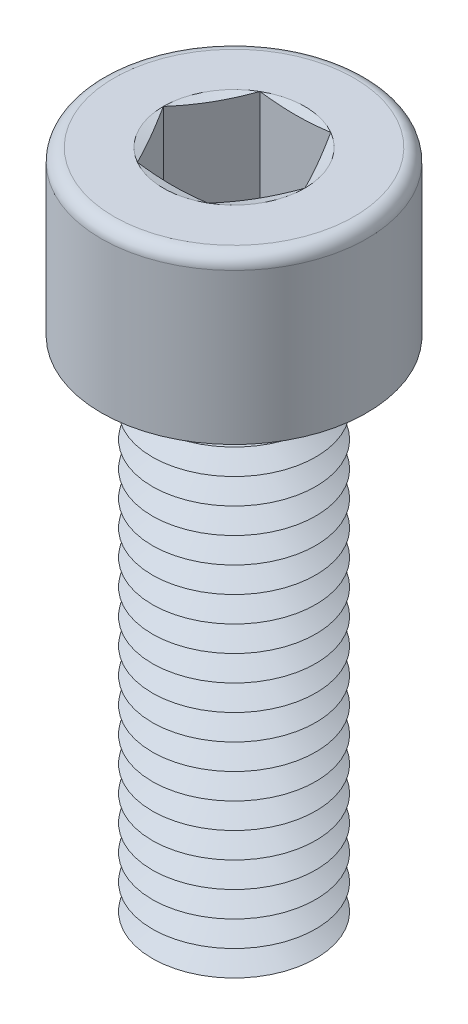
ISO-10303-21;
HEADER;
FILE_DESCRIPTION(('STEP AP214'),'2;1');
FILE_NAME('part.step','',(''),(''),'','','');
FILE_SCHEMA(('AUTOMOTIVE_DESIGN { 1 0 10303 214 1 1 1 1 }'));
ENDSEC;
DATA;
#1=APPLICATION_CONTEXT('core data for automotive mechanical design processes');
#2=APPLICATION_PROTOCOL_DEFINITION('international standard','automotive_design',2000,#1);
#3=PRODUCT_CONTEXT('',#1,'mechanical');
#4=PRODUCT('Part','Part','',(#3));
#5=PRODUCT_RELATED_PRODUCT_CATEGORY('part','',(#4));
#6=PRODUCT_DEFINITION_FORMATION('','',#4);
#7=PRODUCT_DEFINITION_CONTEXT('part definition',#1,'design');
#8=PRODUCT_DEFINITION('design','',#6,#7);
#9=PRODUCT_DEFINITION_SHAPE('','',#8);
#10=(LENGTH_UNIT() NAMED_UNIT(*) SI_UNIT(.MILLI.,.METRE.));
#11=(NAMED_UNIT(*) PLANE_ANGLE_UNIT() SI_UNIT($,.RADIAN.));
#12=(NAMED_UNIT(*) SI_UNIT($,.STERADIAN.) SOLID_ANGLE_UNIT());
#13=UNCERTAINTY_MEASURE_WITH_UNIT(LENGTH_MEASURE(1.E-05),#10,'distance_accuracy_value','');
#14=(GEOMETRIC_REPRESENTATION_CONTEXT(3) GLOBAL_UNCERTAINTY_ASSIGNED_CONTEXT((#13)) GLOBAL_UNIT_ASSIGNED_CONTEXT((#10,
#11,#12)) REPRESENTATION_CONTEXT('',''));
#15=CARTESIAN_POINT('',(0.,0.,0.));
#16=DIRECTION('',(0.,0.,1.));
#17=DIRECTION('',(1.,0.,0.));
#18=AXIS2_PLACEMENT_3D('',#15,#16,#17);
#19=CARTESIAN_POINT('',(0.,5.,0.));
#20=DIRECTION('',(0.,1.,0.));
#21=DIRECTION('',(0.,0.,1.));
#22=AXIS2_PLACEMENT_3D('',#19,#20,#21);
#23=CONICAL_SURFACE('',#22,2.91746824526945,1.0471975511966);
#24=CARTESIAN_POINT('',(0.,5.625,0.));
#25=DIRECTION('',(0.,1.,0.));
#26=DIRECTION('',(0.,0.,1.));
#27=AXIS2_PLACEMENT_3D('',#24,#25,#26);
#28=CIRCLE('',#27,4.);
#29=CARTESIAN_POINT('',(0.,5.625,4.));
#30=VERTEX_POINT('',#29);
#31=EDGE_CURVE('E471',#30,#30,#28,.T.);
#32=ORIENTED_EDGE('',*,*,#31,.F.);
#33=EDGE_LOOP('',(#32));
#34=FACE_BOUND('',#33,.T.);
#35=CARTESIAN_POINT('',(0.,5.,0.));
#36=DIRECTION('',(0.,1.,0.));
#37=DIRECTION('',(0.,0.,1.));
#38=AXIS2_PLACEMENT_3D('',#35,#36,#37);
#39=CIRCLE('',#38,2.91746824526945);
#40=CARTESIAN_POINT('',(0.,5.,2.91746824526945));
#41=VERTEX_POINT('',#40);
#42=EDGE_CURVE('E475',#41,#41,#39,.T.);
#43=ORIENTED_EDGE('',*,*,#42,.T.);
#44=EDGE_LOOP('',(#43));
#45=FACE_BOUND('',#44,.T.);
#46=ADVANCED_FACE('F41',(#34,#45),#23,.T.);
#47=CARTESIAN_POINT('',(0.,4.375,0.));
#48=DIRECTION('',(0.,-1.,0.));
#49=DIRECTION('',(0.,0.,-1.));
#50=AXIS2_PLACEMENT_3D('',#47,#48,#49);
#51=CONICAL_SURFACE('',#50,4.,1.0471975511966);
#52=ORIENTED_EDGE('',*,*,#42,.F.);
#53=EDGE_LOOP('',(#52));
#54=FACE_BOUND('',#53,.T.);
#55=CARTESIAN_POINT('',(0.,4.375,0.));
#56=DIRECTION('',(0.,1.,0.));
#57=DIRECTION('',(0.,0.,1.));
#58=AXIS2_PLACEMENT_3D('',#55,#56,#57);
#59=CIRCLE('',#58,4.);
#60=CARTESIAN_POINT('',(0.,4.375,4.));
#61=VERTEX_POINT('',#60);
#62=EDGE_CURVE('E479',#61,#61,#59,.T.);
#63=ORIENTED_EDGE('',*,*,#62,.T.);
#64=EDGE_LOOP('',(#63));
#65=FACE_BOUND('',#64,.T.);
#66=ADVANCED_FACE('F251',(#54,#65),#51,.T.);
#67=CARTESIAN_POINT('',(0.,0.,0.));
#68=DIRECTION('',(0.,1.,0.));
#69=DIRECTION('',(0.,0.,1.));
#70=AXIS2_PLACEMENT_3D('',#67,#68,#69);
#71=PLANE('',#70);
#72=CARTESIAN_POINT('',(0.,0.,0.));
#73=DIRECTION('',(0.,1.,0.));
#74=DIRECTION('',(0.,0.,1.));
#75=AXIS2_PLACEMENT_3D('',#72,#73,#74);
#76=CIRCLE('',#75,2.91746824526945);
#77=CARTESIAN_POINT('',(0.,0.,2.91746824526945));
#78=VERTEX_POINT('',#77);
#79=EDGE_CURVE('E507',#78,#78,#76,.T.);
#80=ORIENTED_EDGE('',*,*,#79,.F.);
#81=EDGE_LOOP('',(#80));
#82=FACE_BOUND('',#81,.T.);
#83=ADVANCED_FACE('F248',(#82),#71,.F.);
#84=CARTESIAN_POINT('',(0.,0.,0.));
#85=DIRECTION('',(0.,1.,0.));
#86=DIRECTION('',(0.,0.,1.));
#87=AXIS2_PLACEMENT_3D('',#84,#85,#86);
#88=CONICAL_SURFACE('',#87,2.91746824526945,1.0471975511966);
#89=CARTESIAN_POINT('',(0.,0.624999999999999,0.));
#90=DIRECTION('',(0.,1.,0.));
#91=DIRECTION('',(0.,0.,1.));
#92=AXIS2_PLACEMENT_3D('',#89,#90,#91);
#93=CIRCLE('',#92,4.);
#94=CARTESIAN_POINT('',(0.,0.624999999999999,4.));
#95=VERTEX_POINT('',#94);
#96=EDGE_CURVE('E503',#95,#95,#93,.T.);
#97=ORIENTED_EDGE('',*,*,#96,.F.);
#98=EDGE_LOOP('',(#97));
#99=FACE_BOUND('',#98,.T.);
#100=ORIENTED_EDGE('',*,*,#79,.T.);
#101=EDGE_LOOP('',(#100));
#102=FACE_BOUND('',#101,.T.);
#103=ADVANCED_FACE('F250',(#99,#102),#88,.T.);
#104=CARTESIAN_POINT('',(0.,0.624999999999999,0.));
#105=DIRECTION('',(0.,-1.,0.));
#106=DIRECTION('',(0.,0.,-1.));
#107=AXIS2_PLACEMENT_3D('',#104,#105,#106);
#108=CONICAL_SURFACE('',#107,4.,1.0471975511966);
#109=CARTESIAN_POINT('',(0.,1.25,0.));
#110=DIRECTION('',(0.,1.,0.));
#111=DIRECTION('',(0.,0.,1.));
#112=AXIS2_PLACEMENT_3D('',#109,#110,#111);
#113=CIRCLE('',#112,2.91746824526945);
#114=CARTESIAN_POINT('',(0.,1.25,2.91746824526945));
#115=VERTEX_POINT('',#114);
#116=EDGE_CURVE('E499',#115,#115,#113,.T.);
#117=ORIENTED_EDGE('',*,*,#116,.F.);
#118=EDGE_LOOP('',(#117));
#119=FACE_BOUND('',#118,.T.);
#120=ORIENTED_EDGE('',*,*,#96,.T.);
#121=EDGE_LOOP('',(#120));
#122=FACE_BOUND('',#121,.T.);
#123=ADVANCED_FACE('F291',(#119,#122),#108,.T.);
#124=CARTESIAN_POINT('',(0.,1.25,0.));
#125=DIRECTION('',(0.,1.,0.));
#126=DIRECTION('',(0.,0.,1.));
#127=AXIS2_PLACEMENT_3D('',#124,#125,#126);
#128=CONICAL_SURFACE('',#127,2.91746824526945,1.0471975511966);
#129=CARTESIAN_POINT('',(0.,1.875,0.));
#130=DIRECTION('',(0.,1.,0.));
#131=DIRECTION('',(0.,0.,1.));
#132=AXIS2_PLACEMENT_3D('',#129,#130,#131);
#133=CIRCLE('',#132,4.);
#134=CARTESIAN_POINT('',(0.,1.875,4.));
#135=VERTEX_POINT('',#134);
#136=EDGE_CURVE('E495',#135,#135,#133,.T.);
#137=ORIENTED_EDGE('',*,*,#136,.F.);
#138=EDGE_LOOP('',(#137));
#139=FACE_BOUND('',#138,.T.);
#140=ORIENTED_EDGE('',*,*,#116,.T.);
#141=EDGE_LOOP('',(#140));
#142=FACE_BOUND('',#141,.T.);
#143=ADVANCED_FACE('F286',(#139,#142),#128,.T.);
#144=CARTESIAN_POINT('',(0.,1.875,0.));
#145=DIRECTION('',(0.,-1.,0.));
#146=DIRECTION('',(0.,0.,-1.));
#147=AXIS2_PLACEMENT_3D('',#144,#145,#146);
#148=CONICAL_SURFACE('',#147,4.,1.0471975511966);
#149=CARTESIAN_POINT('',(0.,2.5,0.));
#150=DIRECTION('',(0.,1.,0.));
#151=DIRECTION('',(0.,0.,1.));
#152=AXIS2_PLACEMENT_3D('',#149,#150,#151);
#153=CIRCLE('',#152,2.91746824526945);
#154=CARTESIAN_POINT('',(0.,2.5,2.91746824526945));
#155=VERTEX_POINT('',#154);
#156=EDGE_CURVE('E491',#155,#155,#153,.T.);
#157=ORIENTED_EDGE('',*,*,#156,.F.);
#158=EDGE_LOOP('',(#157));
#159=FACE_BOUND('',#158,.T.);
#160=ORIENTED_EDGE('',*,*,#136,.T.);
#161=EDGE_LOOP('',(#160));
#162=FACE_BOUND('',#161,.T.);
#163=ADVANCED_FACE('F283',(#159,#162),#148,.T.);
#164=CARTESIAN_POINT('',(0.,2.5,0.));
#165=DIRECTION('',(0.,1.,0.));
#166=DIRECTION('',(0.,0.,1.));
#167=AXIS2_PLACEMENT_3D('',#164,#165,#166);
#168=CONICAL_SURFACE('',#167,2.91746824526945,1.0471975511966);
#169=CARTESIAN_POINT('',(0.,3.125,0.));
#170=DIRECTION('',(0.,1.,0.));
#171=DIRECTION('',(0.,0.,1.));
#172=AXIS2_PLACEMENT_3D('',#169,#170,#171);
#173=CIRCLE('',#172,4.);
#174=CARTESIAN_POINT('',(0.,3.125,4.));
#175=VERTEX_POINT('',#174);
#176=EDGE_CURVE('E487',#175,#175,#173,.T.);
#177=ORIENTED_EDGE('',*,*,#176,.F.);
#178=EDGE_LOOP('',(#177));
#179=FACE_BOUND('',#178,.T.);
#180=ORIENTED_EDGE('',*,*,#156,.T.);
#181=EDGE_LOOP('',(#180));
#182=FACE_BOUND('',#181,.T.);
#183=ADVANCED_FACE('F277',(#179,#182),#168,.T.);
#184=CARTESIAN_POINT('',(0.,3.125,0.));
#185=DIRECTION('',(0.,-1.,0.));
#186=DIRECTION('',(0.,0.,-1.));
#187=AXIS2_PLACEMENT_3D('',#184,#185,#186);
#188=CONICAL_SURFACE('',#187,4.,1.0471975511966);
#189=CARTESIAN_POINT('',(0.,3.75,0.));
#190=DIRECTION('',(0.,1.,0.));
#191=DIRECTION('',(0.,0.,1.));
#192=AXIS2_PLACEMENT_3D('',#189,#190,#191);
#193=CIRCLE('',#192,2.91746824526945);
#194=CARTESIAN_POINT('',(0.,3.75,2.91746824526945));
#195=VERTEX_POINT('',#194);
#196=EDGE_CURVE('E483',#195,#195,#193,.T.);
#197=ORIENTED_EDGE('',*,*,#196,.F.);
#198=EDGE_LOOP('',(#197));
#199=FACE_BOUND('',#198,.T.);
#200=ORIENTED_EDGE('',*,*,#176,.T.);
#201=EDGE_LOOP('',(#200));
#202=FACE_BOUND('',#201,.T.);
#203=ADVANCED_FACE('F273',(#199,#202),#188,.T.);
#204=CARTESIAN_POINT('',(0.,3.75,0.));
#205=DIRECTION('',(0.,1.,0.));
#206=DIRECTION('',(0.,0.,1.));
#207=AXIS2_PLACEMENT_3D('',#204,#205,#206);
#208=CONICAL_SURFACE('',#207,2.91746824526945,1.0471975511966);
#209=ORIENTED_EDGE('',*,*,#62,.F.);
#210=EDGE_LOOP('',(#209));
#211=FACE_BOUND('',#210,.T.);
#212=ORIENTED_EDGE('',*,*,#196,.T.);
#213=EDGE_LOOP('',(#212));
#214=FACE_BOUND('',#213,.T.);
#215=ADVANCED_FACE('F276',(#211,#214),#208,.T.);
#216=CARTESIAN_POINT('',(0.,6.25,0.));
#217=DIRECTION('',(0.,1.,0.));
#218=DIRECTION('',(0.,0.,1.));
#219=AXIS2_PLACEMENT_3D('',#216,#217,#218);
#220=CONICAL_SURFACE('',#219,2.91746824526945,1.0471975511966);
#221=CARTESIAN_POINT('',(0.,6.875,0.));
#222=DIRECTION('',(0.,1.,0.));
#223=DIRECTION('',(0.,0.,1.));
#224=AXIS2_PLACEMENT_3D('',#221,#222,#223);
#225=CIRCLE('',#224,4.);
#226=CARTESIAN_POINT('',(0.,6.875,4.));
#227=VERTEX_POINT('',#226);
#228=EDGE_CURVE('E463',#227,#227,#225,.T.);
#229=ORIENTED_EDGE('',*,*,#228,.F.);
#230=EDGE_LOOP('',(#229));
#231=FACE_BOUND('',#230,.T.);
#232=CARTESIAN_POINT('',(0.,6.25,0.));
#233=DIRECTION('',(0.,1.,0.));
#234=DIRECTION('',(0.,0.,1.));
#235=AXIS2_PLACEMENT_3D('',#232,#233,#234);
#236=CIRCLE('',#235,2.91746824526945);
#237=CARTESIAN_POINT('',(0.,6.25,2.91746824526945));
#238=VERTEX_POINT('',#237);
#239=EDGE_CURVE('E467',#238,#238,#236,.T.);
#240=ORIENTED_EDGE('',*,*,#239,.T.);
#241=EDGE_LOOP('',(#240));
#242=FACE_BOUND('',#241,.T.);
#243=ADVANCED_FACE('F281',(#231,#242),#220,.T.);
#244=CARTESIAN_POINT('',(0.,5.625,0.));
#245=DIRECTION('',(0.,-1.,0.));
#246=DIRECTION('',(0.,0.,-1.));
#247=AXIS2_PLACEMENT_3D('',#244,#245,#246);
#248=CONICAL_SURFACE('',#247,4.,1.0471975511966);
#249=ORIENTED_EDGE('',*,*,#239,.F.);
#250=EDGE_LOOP('',(#249));
#251=FACE_BOUND('',#250,.T.);
#252=ORIENTED_EDGE('',*,*,#31,.T.);
#253=EDGE_LOOP('',(#252));
#254=FACE_BOUND('',#253,.T.);
#255=ADVANCED_FACE('F744',(#251,#254),#248,.T.);
#256=CARTESIAN_POINT('',(0.,7.5,0.));
#257=DIRECTION('',(0.,1.,0.));
#258=DIRECTION('',(0.,0.,1.));
#259=AXIS2_PLACEMENT_3D('',#256,#257,#258);
#260=CONICAL_SURFACE('',#259,2.91746824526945,1.0471975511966);
#261=CARTESIAN_POINT('',(0.,8.125,0.));
#262=DIRECTION('',(0.,1.,0.));
#263=DIRECTION('',(0.,0.,1.));
#264=AXIS2_PLACEMENT_3D('',#261,#262,#263);
#265=CIRCLE('',#264,4.);
#266=CARTESIAN_POINT('',(0.,8.125,4.));
#267=VERTEX_POINT('',#266);
#268=EDGE_CURVE('E455',#267,#267,#265,.T.);
#269=ORIENTED_EDGE('',*,*,#268,.F.);
#270=EDGE_LOOP('',(#269));
#271=FACE_BOUND('',#270,.T.);
#272=CARTESIAN_POINT('',(0.,7.5,0.));
#273=DIRECTION('',(0.,1.,0.));
#274=DIRECTION('',(0.,0.,1.));
#275=AXIS2_PLACEMENT_3D('',#272,#273,#274);
#276=CIRCLE('',#275,2.91746824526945);
#277=CARTESIAN_POINT('',(0.,7.5,2.91746824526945));
#278=VERTEX_POINT('',#277);
#279=EDGE_CURVE('E459',#278,#278,#276,.T.);
#280=ORIENTED_EDGE('',*,*,#279,.T.);
#281=EDGE_LOOP('',(#280));
#282=FACE_BOUND('',#281,.T.);
#283=ADVANCED_FACE('F753',(#271,#282),#260,.T.);
#284=CARTESIAN_POINT('',(0.,6.875,0.));
#285=DIRECTION('',(0.,-1.,0.));
#286=DIRECTION('',(0.,0.,-1.));
#287=AXIS2_PLACEMENT_3D('',#284,#285,#286);
#288=CONICAL_SURFACE('',#287,4.,1.0471975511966);
#289=ORIENTED_EDGE('',*,*,#279,.F.);
#290=EDGE_LOOP('',(#289));
#291=FACE_BOUND('',#290,.T.);
#292=ORIENTED_EDGE('',*,*,#228,.T.);
#293=EDGE_LOOP('',(#292));
#294=FACE_BOUND('',#293,.T.);
#295=ADVANCED_FACE('F763',(#291,#294),#288,.T.);
#296=CARTESIAN_POINT('',(0.,8.75,0.));
#297=DIRECTION('',(0.,1.,0.));
#298=DIRECTION('',(0.,0.,1.));
#299=AXIS2_PLACEMENT_3D('',#296,#297,#298);
#300=CONICAL_SURFACE('',#299,2.91746824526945,1.0471975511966);
#301=CARTESIAN_POINT('',(0.,9.375,0.));
#302=DIRECTION('',(0.,1.,0.));
#303=DIRECTION('',(0.,0.,1.));
#304=AXIS2_PLACEMENT_3D('',#301,#302,#303);
#305=CIRCLE('',#304,4.);
#306=CARTESIAN_POINT('',(0.,9.375,4.));
#307=VERTEX_POINT('',#306);
#308=EDGE_CURVE('E447',#307,#307,#305,.T.);
#309=ORIENTED_EDGE('',*,*,#308,.F.);
#310=EDGE_LOOP('',(#309));
#311=FACE_BOUND('',#310,.T.);
#312=CARTESIAN_POINT('',(0.,8.75,0.));
#313=DIRECTION('',(0.,1.,0.));
#314=DIRECTION('',(0.,0.,1.));
#315=AXIS2_PLACEMENT_3D('',#312,#313,#314);
#316=CIRCLE('',#315,2.91746824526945);
#317=CARTESIAN_POINT('',(0.,8.75,2.91746824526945));
#318=VERTEX_POINT('',#317);
#319=EDGE_CURVE('E451',#318,#318,#316,.T.);
#320=ORIENTED_EDGE('',*,*,#319,.T.);
#321=EDGE_LOOP('',(#320));
#322=FACE_BOUND('',#321,.T.);
#323=ADVANCED_FACE('F773',(#311,#322),#300,.T.);
#324=CARTESIAN_POINT('',(0.,8.125,0.));
#325=DIRECTION('',(0.,-1.,0.));
#326=DIRECTION('',(0.,0.,-1.));
#327=AXIS2_PLACEMENT_3D('',#324,#325,#326);
#328=CONICAL_SURFACE('',#327,4.,1.0471975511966);
#329=ORIENTED_EDGE('',*,*,#319,.F.);
#330=EDGE_LOOP('',(#329));
#331=FACE_BOUND('',#330,.T.);
#332=ORIENTED_EDGE('',*,*,#268,.T.);
#333=EDGE_LOOP('',(#332));
#334=FACE_BOUND('',#333,.T.);
#335=ADVANCED_FACE('F783',(#331,#334),#328,.T.);
#336=CARTESIAN_POINT('',(0.,10.,0.));
#337=DIRECTION('',(0.,1.,0.));
#338=DIRECTION('',(0.,0.,1.));
#339=AXIS2_PLACEMENT_3D('',#336,#337,#338);
#340=CONICAL_SURFACE('',#339,2.91746824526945,1.0471975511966);
#341=CARTESIAN_POINT('',(0.,10.625,0.));
#342=DIRECTION('',(0.,1.,0.));
#343=DIRECTION('',(0.,0.,1.));
#344=AXIS2_PLACEMENT_3D('',#341,#342,#343);
#345=CIRCLE('',#344,4.);
#346=CARTESIAN_POINT('',(0.,10.625,4.));
#347=VERTEX_POINT('',#346);
#348=EDGE_CURVE('E440',#347,#347,#345,.T.);
#349=ORIENTED_EDGE('',*,*,#348,.F.);
#350=EDGE_LOOP('',(#349));
#351=FACE_BOUND('',#350,.T.);
#352=CARTESIAN_POINT('',(0.,10.,0.));
#353=DIRECTION('',(0.,1.,0.));
#354=DIRECTION('',(0.,0.,1.));
#355=AXIS2_PLACEMENT_3D('',#352,#353,#354);
#356=CIRCLE('',#355,2.91746824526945);
#357=CARTESIAN_POINT('',(0.,10.,2.91746824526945));
#358=VERTEX_POINT('',#357);
#359=EDGE_CURVE('E444',#358,#358,#356,.T.);
#360=ORIENTED_EDGE('',*,*,#359,.T.);
#361=EDGE_LOOP('',(#360));
#362=FACE_BOUND('',#361,.T.);
#363=ADVANCED_FACE('F793',(#351,#362),#340,.T.);
#364=CARTESIAN_POINT('',(0.,9.375,0.));
#365=DIRECTION('',(0.,-1.,0.));
#366=DIRECTION('',(0.,0.,-1.));
#367=AXIS2_PLACEMENT_3D('',#364,#365,#366);
#368=CONICAL_SURFACE('',#367,4.,1.0471975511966);
#369=ORIENTED_EDGE('',*,*,#359,.F.);
#370=EDGE_LOOP('',(#369));
#371=FACE_BOUND('',#370,.T.);
#372=ORIENTED_EDGE('',*,*,#308,.T.);
#373=EDGE_LOOP('',(#372));
#374=FACE_BOUND('',#373,.T.);
#375=ADVANCED_FACE('F803',(#371,#374),#368,.T.);
#376=CARTESIAN_POINT('',(0.,11.25,0.));
#377=DIRECTION('',(0.,1.,0.));
#378=DIRECTION('',(0.,0.,1.));
#379=AXIS2_PLACEMENT_3D('',#376,#377,#378);
#380=CONICAL_SURFACE('',#379,2.91746824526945,1.0471975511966);
#381=CARTESIAN_POINT('',(0.,11.875,0.));
#382=DIRECTION('',(0.,1.,0.));
#383=DIRECTION('',(0.,0.,1.));
#384=AXIS2_PLACEMENT_3D('',#381,#382,#383);
#385=CIRCLE('',#384,4.);
#386=CARTESIAN_POINT('',(0.,11.875,4.));
#387=VERTEX_POINT('',#386);
#388=EDGE_CURVE('E432',#387,#387,#385,.T.);
#389=ORIENTED_EDGE('',*,*,#388,.F.);
#390=EDGE_LOOP('',(#389));
#391=FACE_BOUND('',#390,.T.);
#392=CARTESIAN_POINT('',(0.,11.25,0.));
#393=DIRECTION('',(0.,1.,0.));
#394=DIRECTION('',(0.,0.,1.));
#395=AXIS2_PLACEMENT_3D('',#392,#393,#394);
#396=CIRCLE('',#395,2.91746824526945);
#397=CARTESIAN_POINT('',(0.,11.25,2.91746824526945));
#398=VERTEX_POINT('',#397);
#399=EDGE_CURVE('E436',#398,#398,#396,.T.);
#400=ORIENTED_EDGE('',*,*,#399,.T.);
#401=EDGE_LOOP('',(#400));
#402=FACE_BOUND('',#401,.T.);
#403=ADVANCED_FACE('F813',(#391,#402),#380,.T.);
#404=CARTESIAN_POINT('',(0.,10.625,0.));
#405=DIRECTION('',(0.,-1.,0.));
#406=DIRECTION('',(0.,0.,-1.));
#407=AXIS2_PLACEMENT_3D('',#404,#405,#406);
#408=CONICAL_SURFACE('',#407,4.,1.0471975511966);
#409=ORIENTED_EDGE('',*,*,#399,.F.);
#410=EDGE_LOOP('',(#409));
#411=FACE_BOUND('',#410,.T.);
#412=ORIENTED_EDGE('',*,*,#348,.T.);
#413=EDGE_LOOP('',(#412));
#414=FACE_BOUND('',#413,.T.);
#415=ADVANCED_FACE('F823',(#411,#414),#408,.T.);
#416=CARTESIAN_POINT('',(0.,12.5,0.));
#417=DIRECTION('',(0.,1.,0.));
#418=DIRECTION('',(0.,0.,1.));
#419=AXIS2_PLACEMENT_3D('',#416,#417,#418);
#420=CONICAL_SURFACE('',#419,2.91746824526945,1.0471975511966);
#421=CARTESIAN_POINT('',(0.,13.125,0.));
#422=DIRECTION('',(0.,1.,0.));
#423=DIRECTION('',(0.,0.,1.));
#424=AXIS2_PLACEMENT_3D('',#421,#422,#423);
#425=CIRCLE('',#424,4.);
#426=CARTESIAN_POINT('',(0.,13.125,4.));
#427=VERTEX_POINT('',#426);
#428=EDGE_CURVE('E424',#427,#427,#425,.T.);
#429=ORIENTED_EDGE('',*,*,#428,.F.);
#430=EDGE_LOOP('',(#429));
#431=FACE_BOUND('',#430,.T.);
#432=CARTESIAN_POINT('',(0.,12.5,0.));
#433=DIRECTION('',(0.,1.,0.));
#434=DIRECTION('',(0.,0.,1.));
#435=AXIS2_PLACEMENT_3D('',#432,#433,#434);
#436=CIRCLE('',#435,2.91746824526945);
#437=CARTESIAN_POINT('',(0.,12.5,2.91746824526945));
#438=VERTEX_POINT('',#437);
#439=EDGE_CURVE('E428',#438,#438,#436,.T.);
#440=ORIENTED_EDGE('',*,*,#439,.T.);
#441=EDGE_LOOP('',(#440));
#442=FACE_BOUND('',#441,.T.);
#443=ADVANCED_FACE('F833',(#431,#442),#420,.T.);
#444=CARTESIAN_POINT('',(0.,11.875,0.));
#445=DIRECTION('',(0.,-1.,0.));
#446=DIRECTION('',(0.,0.,-1.));
#447=AXIS2_PLACEMENT_3D('',#444,#445,#446);
#448=CONICAL_SURFACE('',#447,4.,1.0471975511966);
#449=ORIENTED_EDGE('',*,*,#439,.F.);
#450=EDGE_LOOP('',(#449));
#451=FACE_BOUND('',#450,.T.);
#452=ORIENTED_EDGE('',*,*,#388,.T.);
#453=EDGE_LOOP('',(#452));
#454=FACE_BOUND('',#453,.T.);
#455=ADVANCED_FACE('F843',(#451,#454),#448,.T.);
#456=CARTESIAN_POINT('',(0.,13.75,0.));
#457=DIRECTION('',(0.,1.,0.));
#458=DIRECTION('',(0.,0.,1.));
#459=AXIS2_PLACEMENT_3D('',#456,#457,#458);
#460=CONICAL_SURFACE('',#459,2.91746824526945,1.0471975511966);
#461=CARTESIAN_POINT('',(0.,14.375,0.));
#462=DIRECTION('',(0.,1.,0.));
#463=DIRECTION('',(0.,0.,1.));
#464=AXIS2_PLACEMENT_3D('',#461,#462,#463);
#465=CIRCLE('',#464,4.);
#466=CARTESIAN_POINT('',(0.,14.375,4.));
#467=VERTEX_POINT('',#466);
#468=EDGE_CURVE('E416',#467,#467,#465,.T.);
#469=ORIENTED_EDGE('',*,*,#468,.F.);
#470=EDGE_LOOP('',(#469));
#471=FACE_BOUND('',#470,.T.);
#472=CARTESIAN_POINT('',(0.,13.75,0.));
#473=DIRECTION('',(0.,1.,0.));
#474=DIRECTION('',(0.,0.,1.));
#475=AXIS2_PLACEMENT_3D('',#472,#473,#474);
#476=CIRCLE('',#475,2.91746824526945);
#477=CARTESIAN_POINT('',(0.,13.75,2.91746824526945));
#478=VERTEX_POINT('',#477);
#479=EDGE_CURVE('E420',#478,#478,#476,.T.);
#480=ORIENTED_EDGE('',*,*,#479,.T.);
#481=EDGE_LOOP('',(#480));
#482=FACE_BOUND('',#481,.T.);
#483=ADVANCED_FACE('F853',(#471,#482),#460,.T.);
#484=CARTESIAN_POINT('',(0.,13.125,0.));
#485=DIRECTION('',(0.,-1.,0.));
#486=DIRECTION('',(0.,0.,-1.));
#487=AXIS2_PLACEMENT_3D('',#484,#485,#486);
#488=CONICAL_SURFACE('',#487,4.,1.0471975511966);
#489=ORIENTED_EDGE('',*,*,#479,.F.);
#490=EDGE_LOOP('',(#489));
#491=FACE_BOUND('',#490,.T.);
#492=ORIENTED_EDGE('',*,*,#428,.T.);
#493=EDGE_LOOP('',(#492));
#494=FACE_BOUND('',#493,.T.);
#495=ADVANCED_FACE('F863',(#491,#494),#488,.T.);
#496=CARTESIAN_POINT('',(0.,15.,0.));
#497=DIRECTION('',(0.,1.,0.));
#498=DIRECTION('',(0.,0.,1.));
#499=AXIS2_PLACEMENT_3D('',#496,#497,#498);
#500=CONICAL_SURFACE('',#499,2.91746824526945,1.0471975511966);
#501=CARTESIAN_POINT('',(0.,15.625,0.));
#502=DIRECTION('',(0.,1.,0.));
#503=DIRECTION('',(0.,0.,1.));
#504=AXIS2_PLACEMENT_3D('',#501,#502,#503);
#505=CIRCLE('',#504,4.);
#506=CARTESIAN_POINT('',(0.,15.625,4.));
#507=VERTEX_POINT('',#506);
#508=EDGE_CURVE('E408',#507,#507,#505,.T.);
#509=ORIENTED_EDGE('',*,*,#508,.F.);
#510=EDGE_LOOP('',(#509));
#511=FACE_BOUND('',#510,.T.);
#512=CARTESIAN_POINT('',(0.,15.,0.));
#513=DIRECTION('',(0.,1.,0.));
#514=DIRECTION('',(0.,0.,1.));
#515=AXIS2_PLACEMENT_3D('',#512,#513,#514);
#516=CIRCLE('',#515,2.91746824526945);
#517=CARTESIAN_POINT('',(0.,15.,2.91746824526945));
#518=VERTEX_POINT('',#517);
#519=EDGE_CURVE('E412',#518,#518,#516,.T.);
#520=ORIENTED_EDGE('',*,*,#519,.T.);
#521=EDGE_LOOP('',(#520));
#522=FACE_BOUND('',#521,.T.);
#523=ADVANCED_FACE('F873',(#511,#522),#500,.T.);
#524=CARTESIAN_POINT('',(0.,14.375,0.));
#525=DIRECTION('',(0.,-1.,0.));
#526=DIRECTION('',(0.,0.,-1.));
#527=AXIS2_PLACEMENT_3D('',#524,#525,#526);
#528=CONICAL_SURFACE('',#527,4.,1.0471975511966);
#529=ORIENTED_EDGE('',*,*,#519,.F.);
#530=EDGE_LOOP('',(#529));
#531=FACE_BOUND('',#530,.T.);
#532=ORIENTED_EDGE('',*,*,#468,.T.);
#533=EDGE_LOOP('',(#532));
#534=FACE_BOUND('',#533,.T.);
#535=ADVANCED_FACE('F883',(#531,#534),#528,.T.);
#536=CARTESIAN_POINT('',(0.,16.25,0.));
#537=DIRECTION('',(0.,1.,0.));
#538=DIRECTION('',(0.,0.,1.));
#539=AXIS2_PLACEMENT_3D('',#536,#537,#538);
#540=CONICAL_SURFACE('',#539,2.91746824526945,1.0471975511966);
#541=CARTESIAN_POINT('',(0.,16.875,0.));
#542=DIRECTION('',(0.,1.,0.));
#543=DIRECTION('',(0.,0.,1.));
#544=AXIS2_PLACEMENT_3D('',#541,#542,#543);
#545=CIRCLE('',#544,4.);
#546=CARTESIAN_POINT('',(0.,16.875,4.));
#547=VERTEX_POINT('',#546);
#548=EDGE_CURVE('E400',#547,#547,#545,.T.);
#549=ORIENTED_EDGE('',*,*,#548,.F.);
#550=EDGE_LOOP('',(#549));
#551=FACE_BOUND('',#550,.T.);
#552=CARTESIAN_POINT('',(0.,16.25,0.));
#553=DIRECTION('',(0.,1.,0.));
#554=DIRECTION('',(0.,0.,1.));
#555=AXIS2_PLACEMENT_3D('',#552,#553,#554);
#556=CIRCLE('',#555,2.91746824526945);
#557=CARTESIAN_POINT('',(0.,16.25,2.91746824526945));
#558=VERTEX_POINT('',#557);
#559=EDGE_CURVE('E404',#558,#558,#556,.T.);
#560=ORIENTED_EDGE('',*,*,#559,.T.);
#561=EDGE_LOOP('',(#560));
#562=FACE_BOUND('',#561,.T.);
#563=ADVANCED_FACE('F893',(#551,#562),#540,.T.);
#564=CARTESIAN_POINT('',(0.,15.625,0.));
#565=DIRECTION('',(0.,-1.,0.));
#566=DIRECTION('',(0.,0.,-1.));
#567=AXIS2_PLACEMENT_3D('',#564,#565,#566);
#568=CONICAL_SURFACE('',#567,4.,1.0471975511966);
#569=ORIENTED_EDGE('',*,*,#559,.F.);
#570=EDGE_LOOP('',(#569));
#571=FACE_BOUND('',#570,.T.);
#572=ORIENTED_EDGE('',*,*,#508,.T.);
#573=EDGE_LOOP('',(#572));
#574=FACE_BOUND('',#573,.T.);
#575=ADVANCED_FACE('F903',(#571,#574),#568,.T.);
#576=CARTESIAN_POINT('',(0.,17.5,0.));
#577=DIRECTION('',(0.,1.,0.));
#578=DIRECTION('',(0.,0.,1.));
#579=AXIS2_PLACEMENT_3D('',#576,#577,#578);
#580=CONICAL_SURFACE('',#579,2.91746824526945,1.0471975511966);
#581=CARTESIAN_POINT('',(0.,18.125,0.));
#582=DIRECTION('',(0.,1.,0.));
#583=DIRECTION('',(0.,0.,1.));
#584=AXIS2_PLACEMENT_3D('',#581,#582,#583);
#585=CIRCLE('',#584,4.);
#586=CARTESIAN_POINT('',(0.,18.125,4.));
#587=VERTEX_POINT('',#586);
#588=EDGE_CURVE('E392',#587,#587,#585,.T.);
#589=ORIENTED_EDGE('',*,*,#588,.F.);
#590=EDGE_LOOP('',(#589));
#591=FACE_BOUND('',#590,.T.);
#592=CARTESIAN_POINT('',(0.,17.5,0.));
#593=DIRECTION('',(0.,1.,0.));
#594=DIRECTION('',(0.,0.,1.));
#595=AXIS2_PLACEMENT_3D('',#592,#593,#594);
#596=CIRCLE('',#595,2.91746824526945);
#597=CARTESIAN_POINT('',(0.,17.5,2.91746824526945));
#598=VERTEX_POINT('',#597);
#599=EDGE_CURVE('E396',#598,#598,#596,.T.);
#600=ORIENTED_EDGE('',*,*,#599,.T.);
#601=EDGE_LOOP('',(#600));
#602=FACE_BOUND('',#601,.T.);
#603=ADVANCED_FACE('F913',(#591,#602),#580,.T.);
#604=CARTESIAN_POINT('',(0.,16.875,0.));
#605=DIRECTION('',(0.,-1.,0.));
#606=DIRECTION('',(0.,0.,-1.));
#607=AXIS2_PLACEMENT_3D('',#604,#605,#606);
#608=CONICAL_SURFACE('',#607,4.,1.0471975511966);
#609=ORIENTED_EDGE('',*,*,#599,.F.);
#610=EDGE_LOOP('',(#609));
#611=FACE_BOUND('',#610,.T.);
#612=ORIENTED_EDGE('',*,*,#548,.T.);
#613=EDGE_LOOP('',(#612));
#614=FACE_BOUND('',#613,.T.);
#615=ADVANCED_FACE('F923',(#611,#614),#608,.T.);
#616=CARTESIAN_POINT('',(0.,18.75,0.));
#617=DIRECTION('',(0.,1.,0.));
#618=DIRECTION('',(0.,0.,1.));
#619=AXIS2_PLACEMENT_3D('',#616,#617,#618);
#620=CONICAL_SURFACE('',#619,2.91746824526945,1.0471975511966);
#621=CARTESIAN_POINT('',(0.,19.375,0.));
#622=DIRECTION('',(0.,1.,0.));
#623=DIRECTION('',(0.,0.,1.));
#624=AXIS2_PLACEMENT_3D('',#621,#622,#623);
#625=CIRCLE('',#624,4.);
#626=CARTESIAN_POINT('',(0.,19.375,4.));
#627=VERTEX_POINT('',#626);
#628=EDGE_CURVE('E384',#627,#627,#625,.T.);
#629=ORIENTED_EDGE('',*,*,#628,.F.);
#630=EDGE_LOOP('',(#629));
#631=FACE_BOUND('',#630,.T.);
#632=CARTESIAN_POINT('',(0.,18.75,0.));
#633=DIRECTION('',(0.,1.,0.));
#634=DIRECTION('',(0.,0.,1.));
#635=AXIS2_PLACEMENT_3D('',#632,#633,#634);
#636=CIRCLE('',#635,2.91746824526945);
#637=CARTESIAN_POINT('',(0.,18.75,2.91746824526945));
#638=VERTEX_POINT('',#637);
#639=EDGE_CURVE('E388',#638,#638,#636,.T.);
#640=ORIENTED_EDGE('',*,*,#639,.T.);
#641=EDGE_LOOP('',(#640));
#642=FACE_BOUND('',#641,.T.);
#643=ADVANCED_FACE('F933',(#631,#642),#620,.T.);
#644=CARTESIAN_POINT('',(0.,18.125,0.));
#645=DIRECTION('',(0.,-1.,0.));
#646=DIRECTION('',(0.,0.,-1.));
#647=AXIS2_PLACEMENT_3D('',#644,#645,#646);
#648=CONICAL_SURFACE('',#647,4.,1.0471975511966);
#649=ORIENTED_EDGE('',*,*,#639,.F.);
#650=EDGE_LOOP('',(#649));
#651=FACE_BOUND('',#650,.T.);
#652=ORIENTED_EDGE('',*,*,#588,.T.);
#653=EDGE_LOOP('',(#652));
#654=FACE_BOUND('',#653,.T.);
#655=ADVANCED_FACE('F943',(#651,#654),#648,.T.);
#656=CARTESIAN_POINT('',(0.,20.,0.));
#657=DIRECTION('',(0.,1.,0.));
#658=DIRECTION('',(0.,0.,1.));
#659=AXIS2_PLACEMENT_3D('',#656,#657,#658);
#660=CONICAL_SURFACE('',#659,2.91746824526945,1.0471975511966);
#661=CARTESIAN_POINT('',(0.,20.625,0.));
#662=DIRECTION('',(0.,1.,0.));
#663=DIRECTION('',(0.,0.,1.));
#664=AXIS2_PLACEMENT_3D('',#661,#662,#663);
#665=CIRCLE('',#664,4.);
#666=CARTESIAN_POINT('',(0.,20.625,4.));
#667=VERTEX_POINT('',#666);
#668=EDGE_CURVE('E377',#667,#667,#665,.T.);
#669=ORIENTED_EDGE('',*,*,#668,.F.);
#670=EDGE_LOOP('',(#669));
#671=FACE_BOUND('',#670,.T.);
#672=CARTESIAN_POINT('',(0.,20.,0.));
#673=DIRECTION('',(0.,1.,0.));
#674=DIRECTION('',(0.,0.,1.));
#675=AXIS2_PLACEMENT_3D('',#672,#673,#674);
#676=CIRCLE('',#675,2.91746824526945);
#677=CARTESIAN_POINT('',(0.,20.,2.91746824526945));
#678=VERTEX_POINT('',#677);
#679=EDGE_CURVE('E381',#678,#678,#676,.T.);
#680=ORIENTED_EDGE('',*,*,#679,.T.);
#681=EDGE_LOOP('',(#680));
#682=FACE_BOUND('',#681,.T.);
#683=ADVANCED_FACE('F953',(#671,#682),#660,.T.);
#684=CARTESIAN_POINT('',(0.,19.375,0.));
#685=DIRECTION('',(0.,-1.,0.));
#686=DIRECTION('',(0.,0.,-1.));
#687=AXIS2_PLACEMENT_3D('',#684,#685,#686);
#688=CONICAL_SURFACE('',#687,4.,1.0471975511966);
#689=ORIENTED_EDGE('',*,*,#679,.F.);
#690=EDGE_LOOP('',(#689));
#691=FACE_BOUND('',#690,.T.);
#692=ORIENTED_EDGE('',*,*,#628,.T.);
#693=EDGE_LOOP('',(#692));
#694=FACE_BOUND('',#693,.T.);
#695=ADVANCED_FACE('F963',(#691,#694),#688,.T.);
#696=CARTESIAN_POINT('',(0.,21.25,0.));
#697=DIRECTION('',(0.,1.,0.));
#698=DIRECTION('',(0.,0.,1.));
#699=AXIS2_PLACEMENT_3D('',#696,#697,#698);
#700=CONICAL_SURFACE('',#699,2.91746824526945,1.0471975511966);
#701=CARTESIAN_POINT('',(0.,21.875,0.));
#702=DIRECTION('',(0.,1.,0.));
#703=DIRECTION('',(0.,0.,1.));
#704=AXIS2_PLACEMENT_3D('',#701,#702,#703);
#705=CIRCLE('',#704,4.);
#706=CARTESIAN_POINT('',(0.,21.875,4.));
#707=VERTEX_POINT('',#706);
#708=EDGE_CURVE('E369',#707,#707,#705,.T.);
#709=ORIENTED_EDGE('',*,*,#708,.F.);
#710=EDGE_LOOP('',(#709));
#711=FACE_BOUND('',#710,.T.);
#712=CARTESIAN_POINT('',(0.,21.25,0.));
#713=DIRECTION('',(0.,1.,0.));
#714=DIRECTION('',(0.,0.,1.));
#715=AXIS2_PLACEMENT_3D('',#712,#713,#714);
#716=CIRCLE('',#715,2.91746824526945);
#717=CARTESIAN_POINT('',(0.,21.25,2.91746824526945));
#718=VERTEX_POINT('',#717);
#719=EDGE_CURVE('E373',#718,#718,#716,.T.);
#720=ORIENTED_EDGE('',*,*,#719,.T.);
#721=EDGE_LOOP('',(#720));
#722=FACE_BOUND('',#721,.T.);
#723=ADVANCED_FACE('F973',(#711,#722),#700,.T.);
#724=CARTESIAN_POINT('',(0.,20.625,0.));
#725=DIRECTION('',(0.,-1.,0.));
#726=DIRECTION('',(0.,0.,-1.));
#727=AXIS2_PLACEMENT_3D('',#724,#725,#726);
#728=CONICAL_SURFACE('',#727,4.,1.0471975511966);
#729=ORIENTED_EDGE('',*,*,#719,.F.);
#730=EDGE_LOOP('',(#729));
#731=FACE_BOUND('',#730,.T.);
#732=ORIENTED_EDGE('',*,*,#668,.T.);
#733=EDGE_LOOP('',(#732));
#734=FACE_BOUND('',#733,.T.);
#735=ADVANCED_FACE('F983',(#731,#734),#728,.T.);
#736=CARTESIAN_POINT('',(0.,22.5,0.));
#737=DIRECTION('',(0.,1.,0.));
#738=DIRECTION('',(0.,0.,1.));
#739=AXIS2_PLACEMENT_3D('',#736,#737,#738);
#740=CONICAL_SURFACE('',#739,2.91746824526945,1.0471975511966);
#741=CARTESIAN_POINT('',(0.,23.125,0.));
#742=DIRECTION('',(0.,1.,0.));
#743=DIRECTION('',(0.,0.,1.));
#744=AXIS2_PLACEMENT_3D('',#741,#742,#743);
#745=CIRCLE('',#744,4.);
#746=CARTESIAN_POINT('',(0.,23.125,4.));
#747=VERTEX_POINT('',#746);
#748=EDGE_CURVE('E353',#747,#747,#745,.T.);
#749=ORIENTED_EDGE('',*,*,#748,.F.);
#750=EDGE_LOOP('',(#749));
#751=FACE_BOUND('',#750,.T.);
#752=CARTESIAN_POINT('',(0.,22.5,0.));
#753=DIRECTION('',(0.,1.,0.));
#754=DIRECTION('',(0.,0.,1.));
#755=AXIS2_PLACEMENT_3D('',#752,#753,#754);
#756=CIRCLE('',#755,2.91746824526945);
#757=CARTESIAN_POINT('',(0.,22.5,2.91746824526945));
#758=VERTEX_POINT('',#757);
#759=EDGE_CURVE('E365',#758,#758,#756,.T.);
#760=ORIENTED_EDGE('',*,*,#759,.T.);
#761=EDGE_LOOP('',(#760));
#762=FACE_BOUND('',#761,.T.);
#763=ADVANCED_FACE('F993',(#751,#762),#740,.T.);
#764=CARTESIAN_POINT('',(0.,21.875,0.));
#765=DIRECTION('',(0.,-1.,0.));
#766=DIRECTION('',(0.,0.,-1.));
#767=AXIS2_PLACEMENT_3D('',#764,#765,#766);
#768=CONICAL_SURFACE('',#767,4.,1.0471975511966);
#769=ORIENTED_EDGE('',*,*,#759,.F.);
#770=EDGE_LOOP('',(#769));
#771=FACE_BOUND('',#770,.T.);
#772=ORIENTED_EDGE('',*,*,#708,.T.);
#773=EDGE_LOOP('',(#772));
#774=FACE_BOUND('',#773,.T.);
#775=ADVANCED_FACE('F1003',(#771,#774),#768,.T.);
#776=CARTESIAN_POINT('',(0.,23.75,0.));
#777=DIRECTION('',(0.,1.,0.));
#778=DIRECTION('',(0.,0.,1.));
#779=AXIS2_PLACEMENT_3D('',#776,#777,#778);
#780=CONICAL_SURFACE('',#779,2.91746824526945,1.0471975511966);
#781=CARTESIAN_POINT('',(0.,24.375,0.));
#782=DIRECTION('',(0.,1.,0.));
#783=DIRECTION('',(0.,0.,1.));
#784=AXIS2_PLACEMENT_3D('',#781,#782,#783);
#785=CIRCLE('',#784,4.);
#786=CARTESIAN_POINT('',(0.,24.375,4.));
#787=VERTEX_POINT('',#786);
#788=EDGE_CURVE('E360',#787,#787,#785,.T.);
#789=ORIENTED_EDGE('',*,*,#788,.F.);
#790=EDGE_LOOP('',(#789));
#791=FACE_BOUND('',#790,.T.);
#792=CARTESIAN_POINT('',(0.,23.75,0.));
#793=DIRECTION('',(0.,1.,0.));
#794=DIRECTION('',(0.,0.,1.));
#795=AXIS2_PLACEMENT_3D('',#792,#793,#794);
#796=CIRCLE('',#795,2.91746824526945);
#797=CARTESIAN_POINT('',(0.,23.75,2.91746824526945));
#798=VERTEX_POINT('',#797);
#799=EDGE_CURVE('E348',#798,#798,#796,.T.);
#800=ORIENTED_EDGE('',*,*,#799,.T.);
#801=EDGE_LOOP('',(#800));
#802=FACE_BOUND('',#801,.T.);
#803=ADVANCED_FACE('F1013',(#791,#802),#780,.T.);
#804=CARTESIAN_POINT('',(0.,23.125,0.));
#805=DIRECTION('',(0.,-1.,0.));
#806=DIRECTION('',(0.,0.,-1.));
#807=AXIS2_PLACEMENT_3D('',#804,#805,#806);
#808=CONICAL_SURFACE('',#807,4.,1.0471975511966);
#809=ORIENTED_EDGE('',*,*,#799,.F.);
#810=EDGE_LOOP('',(#809));
#811=FACE_BOUND('',#810,.T.);
#812=ORIENTED_EDGE('',*,*,#748,.T.);
#813=EDGE_LOOP('',(#812));
#814=FACE_BOUND('',#813,.T.);
#815=ADVANCED_FACE('F195',(#811,#814),#808,.T.);
#816=CARTESIAN_POINT('',(0.,33.,0.));
#817=DIRECTION('',(0.,1.,0.));
#818=DIRECTION('',(0.,0.,1.));
#819=AXIS2_PLACEMENT_3D('',#816,#817,#818);
#820=PLANE('',#819);
#821=CARTESIAN_POINT('',(0.,33.,0.));
#822=DIRECTION('',(0.,1.,0.));
#823=DIRECTION('',(0.,0.,1.));
#824=AXIS2_PLACEMENT_3D('',#821,#822,#823);
#825=CIRCLE('',#824,3.46410161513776);
#826=CARTESIAN_POINT('',(1.73205080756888,33.,3.));
#827=VERTEX_POINT('',#826);
#828=CARTESIAN_POINT('',(3.46410161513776,33.,0.));
#829=VERTEX_POINT('',#828);
#830=EDGE_CURVE('E121',#827,#829,#825,.T.);
#831=ORIENTED_EDGE('',*,*,#830,.F.);
#832=CARTESIAN_POINT('',(0.,33.,0.));
#833=DIRECTION('',(0.,1.,0.));
#834=DIRECTION('',(0.,0.,1.));
#835=AXIS2_PLACEMENT_3D('',#832,#833,#834);
#836=CIRCLE('',#835,3.46410161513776);
#837=CARTESIAN_POINT('',(-1.73205080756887,33.,3.));
#838=VERTEX_POINT('',#837);
#839=EDGE_CURVE('E45',#838,#827,#836,.T.);
#840=ORIENTED_EDGE('',*,*,#839,.F.);
#841=CARTESIAN_POINT('',(-3.46410161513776,33.,0.));
#842=VERTEX_POINT('',#841);
#843=EDGE_CURVE('E138',#842,#838,#836,.T.);
#844=ORIENTED_EDGE('',*,*,#843,.F.);
#845=CARTESIAN_POINT('',(-1.73205080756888,33.,-3.));
#846=VERTEX_POINT('',#845);
#847=EDGE_CURVE('E577',#846,#842,#836,.T.);
#848=ORIENTED_EDGE('',*,*,#847,.F.);
#849=CARTESIAN_POINT('',(1.73205080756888,33.,-3.));
#850=VERTEX_POINT('',#849);
#851=EDGE_CURVE('E51',#850,#846,#836,.T.);
#852=ORIENTED_EDGE('',*,*,#851,.F.);
#853=EDGE_CURVE('E11',#829,#850,#836,.T.);
#854=ORIENTED_EDGE('',*,*,#853,.F.);
#855=EDGE_LOOP('',(#831,#840,#844,#848,#852,#854));
#856=FACE_BOUND('',#855,.T.);
#857=CARTESIAN_POINT('',(0.,33.,0.));
#858=DIRECTION('',(0.,1.,0.));
#859=DIRECTION('',(0.,0.,1.));
#860=AXIS2_PLACEMENT_3D('',#857,#858,#859);
#861=CIRCLE('',#860,5.875);
#862=CARTESIAN_POINT('',(0.,33.,5.875));
#863=VERTEX_POINT('',#862);
#864=EDGE_CURVE('E550',#863,#863,#861,.T.);
#865=ORIENTED_EDGE('',*,*,#864,.T.);
#866=EDGE_LOOP('',(#865));
#867=FACE_BOUND('',#866,.T.);
#868=ADVANCED_FACE('F140',(#856,#867),#820,.T.);
#869=CARTESIAN_POINT('',(0.,32.375,0.));
#870=DIRECTION('',(0.,1.,0.));
#871=DIRECTION('',(0.,0.,1.));
#872=AXIS2_PLACEMENT_3D('',#869,#870,#871);
#873=TOROIDAL_SURFACE('',#872,5.875,0.625);
#874=CARTESIAN_POINT('',(0.,32.375,0.));
#875=DIRECTION('',(0.,1.,0.));
#876=DIRECTION('',(0.,0.,1.));
#877=AXIS2_PLACEMENT_3D('',#874,#875,#876);
#878=CIRCLE('',#877,6.5);
#879=CARTESIAN_POINT('',(0.,32.375,6.5));
#880=VERTEX_POINT('',#879);
#881=EDGE_CURVE('E554',#880,#880,#878,.F.);
#882=ORIENTED_EDGE('',*,*,#881,.F.);
#883=EDGE_LOOP('',(#882));
#884=FACE_BOUND('',#883,.T.);
#885=ORIENTED_EDGE('',*,*,#864,.F.);
#886=EDGE_LOOP('',(#885));
#887=FACE_BOUND('',#886,.T.);
#888=ADVANCED_FACE('F43',(#884,#887),#873,.T.);
#889=CARTESIAN_POINT('',(0.,33.,0.));
#890=DIRECTION('',(0.,-1.,0.));
#891=DIRECTION('',(0.,0.,-1.));
#892=AXIS2_PLACEMENT_3D('',#889,#890,#891);
#893=CYLINDRICAL_SURFACE('',#892,6.5);
#894=ORIENTED_EDGE('',*,*,#881,.T.);
#895=EDGE_LOOP('',(#894));
#896=FACE_BOUND('',#895,.T.);
#897=CARTESIAN_POINT('',(0.,25.,0.));
#898=DIRECTION('',(0.,1.,0.));
#899=DIRECTION('',(0.,0.,1.));
#900=AXIS2_PLACEMENT_3D('',#897,#898,#899);
#901=CIRCLE('',#900,6.5);
#902=CARTESIAN_POINT('',(0.,25.,6.5));
#903=VERTEX_POINT('',#902);
#904=EDGE_CURVE('E538',#903,#903,#901,.T.);
#905=ORIENTED_EDGE('',*,*,#904,.T.);
#906=EDGE_LOOP('',(#905));
#907=FACE_BOUND('',#906,.T.);
#908=ADVANCED_FACE('F243',(#896,#907),#893,.T.);
#909=CARTESIAN_POINT('',(0.,25.,0.));
#910=DIRECTION('',(0.,1.,0.));
#911=DIRECTION('',(0.,0.,1.));
#912=AXIS2_PLACEMENT_3D('',#909,#910,#911);
#913=PLANE('',#912);
#914=ORIENTED_EDGE('',*,*,#904,.F.);
#915=EDGE_LOOP('',(#914));
#916=FACE_BOUND('',#915,.T.);
#917=CARTESIAN_POINT('',(0.,25.,0.));
#918=DIRECTION('',(0.,1.,0.));
#919=DIRECTION('',(0.,0.,1.));
#920=AXIS2_PLACEMENT_3D('',#917,#918,#919);
#921=CIRCLE('',#920,4.);
#922=CARTESIAN_POINT('',(0.,25.,4.));
#923=VERTEX_POINT('',#922);
#924=EDGE_CURVE('E546',#923,#923,#921,.T.);
#925=ORIENTED_EDGE('',*,*,#924,.T.);
#926=EDGE_LOOP('',(#925));
#927=FACE_BOUND('',#926,.T.);
#928=ADVANCED_FACE('F239',(#916,#927),#913,.F.);
#929=CARTESIAN_POINT('',(0.,25.,0.));
#930=DIRECTION('',(0.,-1.,0.));
#931=DIRECTION('',(0.,0.,-1.));
#932=AXIS2_PLACEMENT_3D('',#929,#930,#931);
#933=CYLINDRICAL_SURFACE('',#932,4.);
#934=ORIENTED_EDGE('',*,*,#788,.T.);
#935=EDGE_LOOP('',(#934));
#936=FACE_BOUND('',#935,.T.);
#937=ORIENTED_EDGE('',*,*,#924,.F.);
#938=EDGE_LOOP('',(#937));
#939=FACE_BOUND('',#938,.T.);
#940=ADVANCED_FACE('F242',(#936,#939),#933,.T.);
#941=CARTESIAN_POINT('',(0.,33.,0.));
#942=DIRECTION('',(0.,1.,0.));
#943=DIRECTION('',(0.,0.,1.));
#944=AXIS2_PLACEMENT_3D('',#941,#942,#943);
#945=CONICAL_SURFACE('',#944,3.46410161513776,1.30899693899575);
#946=ORIENTED_EDGE('',*,*,#839,.T.);
#947=CARTESIAN_POINT('',(-4.52161137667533,33.5257753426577,3.));
#948=CARTESIAN_POINT('',(-4.38614690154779,33.4955374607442,3.));
#949=CARTESIAN_POINT('',(-4.25059605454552,33.4656802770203,3.));
#950=CARTESIAN_POINT('',(-3.97927914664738,33.4069313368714,3.));
#951=CARTESIAN_POINT('',(-3.84351307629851,33.3780396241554,3.));
#952=CARTESIAN_POINT('',(-3.57159492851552,33.3213991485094,3.));
#953=CARTESIAN_POINT('',(-3.43544259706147,33.2936515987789,3.));
#954=CARTESIAN_POINT('',(-3.16285056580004,33.2396142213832,3.));
#955=CARTESIAN_POINT('',(-3.02641086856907,33.213324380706,3.));
#956=CARTESIAN_POINT('',(-2.61896324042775,33.1375690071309,3.));
#957=CARTESIAN_POINT('',(-2.34745999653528,33.0907136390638,3.));
#958=CARTESIAN_POINT('',(-1.80279754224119,33.0077090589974,3.));
#959=CARTESIAN_POINT('',(-1.52963867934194,32.9715576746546,3.));
#960=CARTESIAN_POINT('',(-1.11712206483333,32.9288850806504,3.));
#961=CARTESIAN_POINT('',(-0.978367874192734,32.9165506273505,3.));
#962=CARTESIAN_POINT('',(-0.700531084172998,32.8964911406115,3.));
#963=CARTESIAN_POINT('',(-0.561448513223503,32.8887657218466,3.));
#964=CARTESIAN_POINT('',(-0.283146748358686,32.8783731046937,3.));
#965=CARTESIAN_POINT('',(-0.143927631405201,32.8757038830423,3.));
#966=CARTESIAN_POINT('',(0.134513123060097,32.8755867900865,3.));
#967=CARTESIAN_POINT('',(0.273734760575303,32.8781389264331,3.));
#968=CARTESIAN_POINT('',(0.552556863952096,32.8883235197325,3.));
#969=CARTESIAN_POINT('',(0.692156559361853,32.8959766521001,3.));
#970=CARTESIAN_POINT('',(0.971024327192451,32.9159351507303,3.));
#971=CARTESIAN_POINT('',(1.11029238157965,32.928240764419,3.));
#972=CARTESIAN_POINT('',(1.3884939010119,32.9568974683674,3.));
#973=CARTESIAN_POINT('',(1.52742710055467,32.9732510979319,3.));
#974=CARTESIAN_POINT('',(1.80484805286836,33.0093419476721,3.));
#975=CARTESIAN_POINT('',(1.94333580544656,33.0290791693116,3.));
#976=CARTESIAN_POINT('',(2.2235029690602,33.0718742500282,3.));
#977=CARTESIAN_POINT('',(2.36517107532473,33.0950054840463,3.));
#978=CARTESIAN_POINT('',(2.648104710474,33.143617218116,3.));
#979=CARTESIAN_POINT('',(2.78937022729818,33.1690977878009,3.));
#980=CARTESIAN_POINT('',(3.21267286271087,33.2483421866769,3.));
#981=CARTESIAN_POINT('',(3.49418463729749,33.304903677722,3.));
#982=CARTESIAN_POINT('',(4.05626646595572,33.4228276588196,3.));
#983=CARTESIAN_POINT('',(4.33683622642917,33.4841915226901,3.));
#984=CARTESIAN_POINT('',(4.89726247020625,33.6101124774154,3.));
#985=CARTESIAN_POINT('',(5.17711893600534,33.6746696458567,3.));
#986=CARTESIAN_POINT('',(5.73290235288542,33.8051717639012,3.));
#987=CARTESIAN_POINT('',(6.00883557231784,33.871090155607,3.));
#988=CARTESIAN_POINT('',(6.56033924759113,34.0044513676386,3.));
#989=CARTESIAN_POINT('',(6.83590969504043,34.0718942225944,3.));
#990=CARTESIAN_POINT('',(7.38639195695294,34.2077957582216,3.));
#991=CARTESIAN_POINT('',(7.66130415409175,34.2762528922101,3.));
#992=CARTESIAN_POINT('',(8.21090603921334,34.4140133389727,3.));
#993=CARTESIAN_POINT('',(8.48559573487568,34.4833166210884,3.));
#994=CARTESIAN_POINT('',(8.76020986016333,34.5529148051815,3.));
#995=B_SPLINE_CURVE_WITH_KNOTS('',3,(#947,#948,#949,#950,#951,#952,#953,#954,#955,#956,#957,
#958,#959,#960,#961,#962,#963,#964,#965,#966,#967,#968,#969,#970,#971,#972,#973,#974,#975,#976,
#977,#978,#979,#980,#981,#982,#983,#984,#985,#986,#987,#988,#989,#990,#991,#992,#993,#994),
.UNSPECIFIED.,.F.,.F.,(4,2,2,2,2,2,2,2,2,2,2,2,2,2,2,2,2,2,2,2,2,2,2,4),(0.,0.416396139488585,
0.83281110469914,1.24965681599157,1.66649880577,2.49292514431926,3.31918364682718,
3.73702338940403,4.15482819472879,4.5724657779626,4.99010397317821,5.40944532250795,
5.8288089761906,6.24843636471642,6.66806393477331,7.09867155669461,7.52929194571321,
8.39062817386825,9.25221171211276,10.1138161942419,10.9649037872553,11.8160107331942,
12.6659315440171,13.5158216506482),.UNSPECIFIED.);
#996=EDGE_CURVE('E127',#838,#827,#995,.T.);
#997=ORIENTED_EDGE('',*,*,#996,.F.);
#998=EDGE_LOOP('',(#946,#997));
#999=FACE_BOUND('',#998,.T.);
#1000=ADVANCED_FACE('F132',(#999),#945,.F.);
#1001=ORIENTED_EDGE('',*,*,#843,.T.);
#1002=CARTESIAN_POINT('',(-3.46421708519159,33.0000309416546,-0.000200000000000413));
#1003=CARTESIAN_POINT('',(-3.39227980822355,32.9807461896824,0.124399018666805));
#1004=CARTESIAN_POINT('',(-3.32021209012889,32.9632387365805,0.249223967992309));
#1005=CARTESIAN_POINT('',(-3.17582211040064,32.932479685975,0.49931474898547));
#1006=CARTESIAN_POINT('',(-3.10349975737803,32.9192298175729,0.62458073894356));
#1007=CARTESIAN_POINT('',(-2.95903905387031,32.8977595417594,0.874794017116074));
#1008=CARTESIAN_POINT('',(-2.8869016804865,32.8895135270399,0.999739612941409));
#1009=CARTESIAN_POINT('',(-2.74253492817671,32.8784564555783,1.24979016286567));
#1010=CARTESIAN_POINT('',(-2.67030556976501,32.8756443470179,1.37489508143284));
#1011=CARTESIAN_POINT('',(-2.52584685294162,32.8756443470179,1.62510491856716));
#1012=CARTESIAN_POINT('',(-2.45361749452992,32.8784564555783,1.75020983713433));
#1013=CARTESIAN_POINT('',(-2.30925074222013,32.8895135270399,2.00026038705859));
#1014=CARTESIAN_POINT('',(-2.23711336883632,32.8977595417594,2.12520598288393));
#1015=CARTESIAN_POINT('',(-2.0926526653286,32.9192298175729,2.37541926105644));
#1016=CARTESIAN_POINT('',(-2.02033031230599,32.932479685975,2.50068525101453));
#1017=CARTESIAN_POINT('',(-1.87594033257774,32.9632387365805,2.75077603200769));
#1018=CARTESIAN_POINT('',(-1.80387261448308,32.9807461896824,2.8756009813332));
#1019=CARTESIAN_POINT('',(-1.73193533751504,33.0000309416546,3.0002));
#1020=B_SPLINE_CURVE_WITH_KNOTS('',3,(#1002,#1003,#1004,#1005,#1006,#1007,#1008,#1009,#1010,
#1011,#1012,#1013,#1014,#1015,#1016,#1017,#1018,#1019),.UNSPECIFIED.,.F.,.F.,(4,2,2,2,2,2,2,2,
4),(0.,0.435506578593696,0.87118980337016,1.30462418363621,1.73797465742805,2.17132513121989,
2.60475951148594,3.0404427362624,3.4759493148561),.UNSPECIFIED.);
#1021=EDGE_CURVE('E163',#842,#838,#1020,.T.);
#1022=ORIENTED_EDGE('',*,*,#1021,.F.);
#1023=EDGE_LOOP('',(#1001,#1022));
#1024=FACE_BOUND('',#1023,.T.);
#1025=ADVANCED_FACE('F258',(#1024),#945,.F.);
#1026=ORIENTED_EDGE('',*,*,#847,.T.);
#1027=CARTESIAN_POINT('',(-1.73193533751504,33.0000309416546,-3.0002));
#1028=CARTESIAN_POINT('',(-1.80387261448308,32.9807461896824,-2.87560098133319));
#1029=CARTESIAN_POINT('',(-1.87594033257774,32.9632387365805,-2.75077603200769));
#1030=CARTESIAN_POINT('',(-2.02033031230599,32.932479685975,-2.50068525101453));
#1031=CARTESIAN_POINT('',(-2.0926526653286,32.9192298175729,-2.37541926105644));
#1032=CARTESIAN_POINT('',(-2.23711336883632,32.8977595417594,-2.12520598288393));
#1033=CARTESIAN_POINT('',(-2.30925074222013,32.8895135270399,-2.00026038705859));
#1034=CARTESIAN_POINT('',(-2.45361749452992,32.8784564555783,-1.75020983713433));
#1035=CARTESIAN_POINT('',(-2.52584685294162,32.8756443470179,-1.62510491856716));
#1036=CARTESIAN_POINT('',(-2.67030556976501,32.8756443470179,-1.37489508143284));
#1037=CARTESIAN_POINT('',(-2.74253492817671,32.8784564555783,-1.24979016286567));
#1038=CARTESIAN_POINT('',(-2.8869016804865,32.8895135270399,-0.99973961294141));
#1039=CARTESIAN_POINT('',(-2.95903905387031,32.8977595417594,-0.874794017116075));
#1040=CARTESIAN_POINT('',(-3.10349975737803,32.9192298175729,-0.624580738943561));
#1041=CARTESIAN_POINT('',(-3.17582211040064,32.932479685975,-0.499314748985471));
#1042=CARTESIAN_POINT('',(-3.32021209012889,32.9632387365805,-0.24922396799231));
#1043=CARTESIAN_POINT('',(-3.39227980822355,32.9807461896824,-0.124399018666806));
#1044=CARTESIAN_POINT('',(-3.46421708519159,33.0000309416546,0.00019999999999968));
#1045=B_SPLINE_CURVE_WITH_KNOTS('',3,(#1027,#1028,#1029,#1030,#1031,#1032,#1033,#1034,#1035,
#1036,#1037,#1038,#1039,#1040,#1041,#1042,#1043,#1044),.UNSPECIFIED.,.F.,.F.,(4,2,2,2,2,2,2,2,
4),(0.,0.435506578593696,0.87118980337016,1.30462418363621,1.73797465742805,2.17132513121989,
2.60475951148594,3.0404427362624,3.4759493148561),.UNSPECIFIED.);
#1046=EDGE_CURVE('E63',#846,#842,#1045,.T.);
#1047=ORIENTED_EDGE('',*,*,#1046,.F.);
#1048=EDGE_LOOP('',(#1026,#1047));
#1049=FACE_BOUND('',#1048,.T.);
#1050=ADVANCED_FACE('F193',(#1049),#945,.F.);
#1051=ORIENTED_EDGE('',*,*,#851,.T.);
#1052=CARTESIAN_POINT('',(-4.52161137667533,33.5257753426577,-3.));
#1053=CARTESIAN_POINT('',(-4.38614690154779,33.4955374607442,-3.));
#1054=CARTESIAN_POINT('',(-4.25059605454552,33.4656802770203,-3.));
#1055=CARTESIAN_POINT('',(-3.97927914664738,33.4069313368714,-3.));
#1056=CARTESIAN_POINT('',(-3.84351307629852,33.3780396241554,-3.));
#1057=CARTESIAN_POINT('',(-3.57159492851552,33.3213991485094,-3.));
#1058=CARTESIAN_POINT('',(-3.43544259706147,33.2936515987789,-3.));
#1059=CARTESIAN_POINT('',(-3.16285056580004,33.2396142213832,-3.));
#1060=CARTESIAN_POINT('',(-3.02641086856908,33.213324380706,-3.));
#1061=CARTESIAN_POINT('',(-2.61896324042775,33.1375690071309,-3.));
#1062=CARTESIAN_POINT('',(-2.34745999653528,33.0907136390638,-3.));
#1063=CARTESIAN_POINT('',(-1.80279754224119,33.0077090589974,-3.));
#1064=CARTESIAN_POINT('',(-1.52963867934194,32.9715576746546,-3.));
#1065=CARTESIAN_POINT('',(-1.11712206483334,32.9288850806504,-3.));
#1066=CARTESIAN_POINT('',(-0.978367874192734,32.9165506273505,-3.));
#1067=CARTESIAN_POINT('',(-0.700531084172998,32.8964911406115,-3.));
#1068=CARTESIAN_POINT('',(-0.561448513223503,32.8887657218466,-3.));
#1069=CARTESIAN_POINT('',(-0.283146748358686,32.8783731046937,-3.));
#1070=CARTESIAN_POINT('',(-0.1439276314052,32.8757038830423,-3.));
#1071=CARTESIAN_POINT('',(0.134513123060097,32.8755867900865,-3.));
#1072=CARTESIAN_POINT('',(0.273734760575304,32.8781389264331,-3.));
#1073=CARTESIAN_POINT('',(0.552556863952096,32.8883235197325,-3.));
#1074=CARTESIAN_POINT('',(0.692156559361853,32.8959766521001,-3.));
#1075=CARTESIAN_POINT('',(0.97102432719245,32.9159351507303,-3.));
#1076=CARTESIAN_POINT('',(1.11029238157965,32.928240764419,-3.));
#1077=CARTESIAN_POINT('',(1.3884939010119,32.9568974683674,-3.));
#1078=CARTESIAN_POINT('',(1.52742710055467,32.9732510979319,-3.));
#1079=CARTESIAN_POINT('',(1.80484805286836,33.0093419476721,-3.));
#1080=CARTESIAN_POINT('',(1.94333580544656,33.0290791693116,-3.));
#1081=CARTESIAN_POINT('',(2.2235029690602,33.0718742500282,-3.));
#1082=CARTESIAN_POINT('',(2.36517107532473,33.0950054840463,-3.));
#1083=CARTESIAN_POINT('',(2.648104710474,33.143617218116,-3.));
#1084=CARTESIAN_POINT('',(2.78937022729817,33.1690977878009,-3.));
#1085=CARTESIAN_POINT('',(3.21267286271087,33.2483421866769,-3.));
#1086=CARTESIAN_POINT('',(3.49418463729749,33.304903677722,-3.));
#1087=CARTESIAN_POINT('',(4.05626646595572,33.4228276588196,-3.));
#1088=CARTESIAN_POINT('',(4.33683622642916,33.4841915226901,-3.));
#1089=CARTESIAN_POINT('',(4.89726247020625,33.6101124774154,-3.));
#1090=CARTESIAN_POINT('',(5.17711893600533,33.6746696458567,-3.));
#1091=CARTESIAN_POINT('',(5.73290235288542,33.8051717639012,-3.));
#1092=CARTESIAN_POINT('',(6.00883557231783,33.871090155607,-3.));
#1093=CARTESIAN_POINT('',(6.56033924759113,34.0044513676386,-3.));
#1094=CARTESIAN_POINT('',(6.83590969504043,34.0718942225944,-3.));
#1095=CARTESIAN_POINT('',(7.38639195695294,34.2077957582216,-3.));
#1096=CARTESIAN_POINT('',(7.66130415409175,34.2762528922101,-3.));
#1097=CARTESIAN_POINT('',(8.21090603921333,34.4140133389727,-3.));
#1098=CARTESIAN_POINT('',(8.48559573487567,34.4833166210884,-3.));
#1099=CARTESIAN_POINT('',(8.76020986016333,34.5529148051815,-3.));
#1100=B_SPLINE_CURVE_WITH_KNOTS('',3,(#1052,#1053,#1054,#1055,#1056,#1057,#1058,#1059,#1060,
#1061,#1062,#1063,#1064,#1065,#1066,#1067,#1068,#1069,#1070,#1071,#1072,#1073,#1074,#1075,#1076,
#1077,#1078,#1079,#1080,#1081,#1082,#1083,#1084,#1085,#1086,#1087,#1088,#1089,#1090,#1091,#1092,
#1093,#1094,#1095,#1096,#1097,#1098,#1099),.UNSPECIFIED.,.F.,.F.,(4,2,2,2,2,2,2,2,2,2,2,2,2,2,2,
2,2,2,2,2,2,2,2,4),(0.,0.416396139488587,0.832811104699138,1.24965681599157,1.66649880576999,
2.49292514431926,3.31918364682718,3.73702338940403,4.15482819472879,4.5724657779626,
4.99010397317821,5.40944532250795,5.8288089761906,6.24843636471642,6.66806393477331,
7.0986715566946,7.52929194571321,8.39062817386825,9.25221171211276,10.1138161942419,
10.9649037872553,11.8160107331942,12.6659315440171,13.5158216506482),.UNSPECIFIED.);
#1101=EDGE_CURVE('E214',#850,#846,#1100,.F.);
#1102=ORIENTED_EDGE('',*,*,#1101,.F.);
#1103=EDGE_LOOP('',(#1051,#1102));
#1104=FACE_BOUND('',#1103,.T.);
#1105=ADVANCED_FACE('F188',(#1104),#945,.F.);
#1106=ORIENTED_EDGE('',*,*,#853,.T.);
#1107=CARTESIAN_POINT('',(3.46421708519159,33.0000309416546,0.000200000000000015));
#1108=CARTESIAN_POINT('',(3.39227980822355,32.9807461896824,-0.124399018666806));
#1109=CARTESIAN_POINT('',(3.32021209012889,32.9632387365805,-0.24922396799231));
#1110=CARTESIAN_POINT('',(3.17582211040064,32.932479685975,-0.499314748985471));
#1111=CARTESIAN_POINT('',(3.10349975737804,32.9192298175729,-0.624580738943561));
#1112=CARTESIAN_POINT('',(2.95903905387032,32.8977595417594,-0.874794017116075));
#1113=CARTESIAN_POINT('',(2.8869016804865,32.8895135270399,-0.99973961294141));
#1114=CARTESIAN_POINT('',(2.74253492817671,32.8784564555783,-1.24979016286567));
#1115=CARTESIAN_POINT('',(2.67030556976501,32.8756443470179,-1.37489508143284));
#1116=CARTESIAN_POINT('',(2.52584685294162,32.8756443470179,-1.62510491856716));
#1117=CARTESIAN_POINT('',(2.45361749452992,32.8784564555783,-1.75020983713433));
#1118=CARTESIAN_POINT('',(2.30925074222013,32.8895135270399,-2.00026038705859));
#1119=CARTESIAN_POINT('',(2.23711336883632,32.8977595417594,-2.12520598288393));
#1120=CARTESIAN_POINT('',(2.0926526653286,32.9192298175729,-2.37541926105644));
#1121=CARTESIAN_POINT('',(2.02033031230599,32.932479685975,-2.50068525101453));
#1122=CARTESIAN_POINT('',(1.87594033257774,32.9632387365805,-2.75077603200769));
#1123=CARTESIAN_POINT('',(1.80387261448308,32.9807461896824,-2.87560098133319));
#1124=CARTESIAN_POINT('',(1.73193533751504,33.0000309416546,-3.0002));
#1125=B_SPLINE_CURVE_WITH_KNOTS('',3,(#1107,#1108,#1109,#1110,#1111,#1112,#1113,#1114,#1115,
#1116,#1117,#1118,#1119,#1120,#1121,#1122,#1123,#1124),.UNSPECIFIED.,.F.,.F.,(4,2,2,2,2,2,2,2,
4),(0.,0.435506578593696,0.871189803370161,1.30462418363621,1.73797465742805,2.17132513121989,
2.60475951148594,3.0404427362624,3.4759493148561),.UNSPECIFIED.);
#1126=EDGE_CURVE('E56',#829,#850,#1125,.T.);
#1127=ORIENTED_EDGE('',*,*,#1126,.F.);
#1128=EDGE_LOOP('',(#1106,#1127));
#1129=FACE_BOUND('',#1128,.T.);
#1130=ADVANCED_FACE('F192',(#1129),#945,.F.);
#1131=ORIENTED_EDGE('',*,*,#830,.T.);
#1132=CARTESIAN_POINT('',(1.73193533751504,33.0000309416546,3.0002));
#1133=CARTESIAN_POINT('',(1.80387261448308,32.9807461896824,2.87560098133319));
#1134=CARTESIAN_POINT('',(1.87594033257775,32.9632387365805,2.75077603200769));
#1135=CARTESIAN_POINT('',(2.02033031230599,32.932479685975,2.50068525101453));
#1136=CARTESIAN_POINT('',(2.0926526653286,32.9192298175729,2.37541926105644));
#1137=CARTESIAN_POINT('',(2.23711336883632,32.8977595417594,2.12520598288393));
#1138=CARTESIAN_POINT('',(2.30925074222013,32.8895135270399,2.00026038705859));
#1139=CARTESIAN_POINT('',(2.45361749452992,32.8784564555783,1.75020983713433));
#1140=CARTESIAN_POINT('',(2.52584685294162,32.8756443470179,1.62510491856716));
#1141=CARTESIAN_POINT('',(2.67030556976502,32.8756443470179,1.37489508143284));
#1142=CARTESIAN_POINT('',(2.74253492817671,32.8784564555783,1.24979016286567));
#1143=CARTESIAN_POINT('',(2.8869016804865,32.8895135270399,0.99973961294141));
#1144=CARTESIAN_POINT('',(2.95903905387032,32.8977595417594,0.874794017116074));
#1145=CARTESIAN_POINT('',(3.10349975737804,32.9192298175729,0.62458073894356));
#1146=CARTESIAN_POINT('',(3.17582211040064,32.932479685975,0.499314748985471));
#1147=CARTESIAN_POINT('',(3.32021209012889,32.9632387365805,0.249223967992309));
#1148=CARTESIAN_POINT('',(3.39227980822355,32.9807461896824,0.124399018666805));
#1149=CARTESIAN_POINT('',(3.46421708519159,33.0000309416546,-0.000199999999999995));
#1150=B_SPLINE_CURVE_WITH_KNOTS('',3,(#1132,#1133,#1134,#1135,#1136,#1137,#1138,#1139,#1140,
#1141,#1142,#1143,#1144,#1145,#1146,#1147,#1148,#1149),.UNSPECIFIED.,.F.,.F.,(4,2,2,2,2,2,2,2,
4),(0.,0.435506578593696,0.871189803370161,1.30462418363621,1.73797465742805,2.17132513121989,
2.60475951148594,3.0404427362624,3.4759493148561),.UNSPECIFIED.);
#1151=EDGE_CURVE('E117',#827,#829,#1150,.T.);
#1152=ORIENTED_EDGE('',*,*,#1151,.F.);
#1153=EDGE_LOOP('',(#1131,#1152));
#1154=FACE_BOUND('',#1153,.T.);
#1155=ADVANCED_FACE('F119',(#1154),#945,.F.);
#1156=CARTESIAN_POINT('',(0.,27.,0.));
#1157=DIRECTION('',(0.,1.,0.));
#1158=DIRECTION('',(0.,0.,1.));
#1159=AXIS2_PLACEMENT_3D('',#1156,#1157,#1158);
#1160=CONICAL_SURFACE('',#1159,3.,1.0471975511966);
#1161=CARTESIAN_POINT('',(0.,25.2679491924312,0.));
#1162=VERTEX_POINT('',#1161);
#1163=VERTEX_LOOP('',#1162);
#1164=FACE_BOUND('',#1163,.T.);
#1165=CARTESIAN_POINT('',(0.,27.,0.));
#1166=DIRECTION('',(0.,1.,0.));
#1167=DIRECTION('',(0.,0.,1.));
#1168=AXIS2_PLACEMENT_3D('',#1165,#1166,#1167);
#1169=CIRCLE('',#1168,3.);
#1170=CARTESIAN_POINT('',(0.,27.,3.));
#1171=VERTEX_POINT('',#1170);
#1172=CARTESIAN_POINT('',(2.59807621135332,27.,1.5));
#1173=VERTEX_POINT('',#1172);
#1174=EDGE_CURVE('E511',#1171,#1173,#1169,.T.);
#1175=ORIENTED_EDGE('',*,*,#1174,.T.);
#1176=CARTESIAN_POINT('',(0.,27.,0.));
#1177=DIRECTION('',(0.,1.,0.));
#1178=DIRECTION('',(0.,0.,1.));
#1179=AXIS2_PLACEMENT_3D('',#1176,#1177,#1178);
#1180=CIRCLE('',#1179,3.);
#1181=CARTESIAN_POINT('',(2.59807621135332,27.,-1.5));
#1182=VERTEX_POINT('',#1181);
#1183=EDGE_CURVE('E139',#1173,#1182,#1180,.T.);
#1184=ORIENTED_EDGE('',*,*,#1183,.T.);
#1185=CARTESIAN_POINT('',(0.,27.,-3.));
#1186=VERTEX_POINT('',#1185);
#1187=EDGE_CURVE('E566',#1182,#1186,#1180,.T.);
#1188=ORIENTED_EDGE('',*,*,#1187,.T.);
#1189=CARTESIAN_POINT('',(-2.59807621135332,27.,-1.5));
#1190=VERTEX_POINT('',#1189);
#1191=EDGE_CURVE('E565',#1186,#1190,#1180,.T.);
#1192=ORIENTED_EDGE('',*,*,#1191,.T.);
#1193=CARTESIAN_POINT('',(-2.59807621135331,27.,1.5));
#1194=VERTEX_POINT('',#1193);
#1195=EDGE_CURVE('E559',#1190,#1194,#1180,.T.);
#1196=ORIENTED_EDGE('',*,*,#1195,.T.);
#1197=EDGE_CURVE('E557',#1194,#1171,#1180,.T.);
#1198=ORIENTED_EDGE('',*,*,#1197,.T.);
#1199=EDGE_LOOP('',(#1175,#1184,#1188,#1192,#1196,#1198));
#1200=FACE_BOUND('',#1199,.T.);
#1201=ADVANCED_FACE('F301',(#1164,#1200),#1160,.F.);
#1202=CARTESIAN_POINT('',(1.73205080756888,27.,-3.));
#1203=DIRECTION('',(0.,1.,0.));
#1204=DIRECTION('',(0.,0.,1.));
#1205=AXIS2_PLACEMENT_3D('',#1202,#1203,#1204);
#1206=PLANE('',#1205);
#1207=ORIENTED_EDGE('',*,*,#1191,.F.);
#1208=DIRECTION('',(-1.,0.,0.));
#1209=VECTOR('',#1208,1.);
#1210=CARTESIAN_POINT('',(1.73205080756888,27.,-3.));
#1211=LINE('',#1210,#1209);
#1212=CARTESIAN_POINT('',(-1.73205080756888,27.,-3.));
#1213=VERTEX_POINT('',#1212);
#1214=EDGE_CURVE('E519',#1186,#1213,#1211,.T.);
#1215=ORIENTED_EDGE('',*,*,#1214,.T.);
#1216=DIRECTION('',(-0.5,0.,0.866025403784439));
#1217=VECTOR('',#1216,1.);
#1218=CARTESIAN_POINT('',(-1.73205080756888,27.,-3.));
#1219=LINE('',#1218,#1217);
#1220=EDGE_CURVE('E338',#1213,#1190,#1219,.T.);
#1221=ORIENTED_EDGE('',*,*,#1220,.T.);
#1222=EDGE_LOOP('',(#1207,#1215,#1221));
#1223=FACE_BOUND('',#1222,.T.);
#1224=ADVANCED_FACE('F304',(#1223),#1206,.T.);
#1225=ORIENTED_EDGE('',*,*,#1195,.F.);
#1226=CARTESIAN_POINT('',(-3.46410161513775,27.,0.));
#1227=VERTEX_POINT('',#1226);
#1228=EDGE_CURVE('E524',#1190,#1227,#1219,.T.);
#1229=ORIENTED_EDGE('',*,*,#1228,.T.);
#1230=DIRECTION('',(0.5,0.,0.866025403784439));
#1231=VECTOR('',#1230,1.);
#1232=CARTESIAN_POINT('',(-3.46410161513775,27.,0.));
#1233=LINE('',#1232,#1231);
#1234=EDGE_CURVE('E328',#1227,#1194,#1233,.T.);
#1235=ORIENTED_EDGE('',*,*,#1234,.T.);
#1236=EDGE_LOOP('',(#1225,#1229,#1235));
#1237=FACE_BOUND('',#1236,.T.);
#1238=ADVANCED_FACE('F309',(#1237),#1206,.T.);
#1239=ORIENTED_EDGE('',*,*,#1197,.F.);
#1240=CARTESIAN_POINT('',(-1.73205080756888,27.,3.));
#1241=VERTEX_POINT('',#1240);
#1242=EDGE_CURVE('E527',#1194,#1241,#1233,.T.);
#1243=ORIENTED_EDGE('',*,*,#1242,.T.);
#1244=DIRECTION('',(1.,0.,0.));
#1245=VECTOR('',#1244,1.);
#1246=CARTESIAN_POINT('',(-1.73205080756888,27.,3.));
#1247=LINE('',#1246,#1245);
#1248=EDGE_CURVE('E530',#1241,#1171,#1247,.T.);
#1249=ORIENTED_EDGE('',*,*,#1248,.T.);
#1250=EDGE_LOOP('',(#1239,#1243,#1249));
#1251=FACE_BOUND('',#1250,.T.);
#1252=ADVANCED_FACE('F306',(#1251),#1206,.T.);
#1253=ORIENTED_EDGE('',*,*,#1174,.F.);
#1254=CARTESIAN_POINT('',(1.73205080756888,27.,3.));
#1255=VERTEX_POINT('',#1254);
#1256=EDGE_CURVE('E529',#1171,#1255,#1247,.T.);
#1257=ORIENTED_EDGE('',*,*,#1256,.T.);
#1258=DIRECTION('',(0.5,0.,-0.866025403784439));
#1259=VECTOR('',#1258,1.);
#1260=CARTESIAN_POINT('',(1.73205080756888,27.,3.));
#1261=LINE('',#1260,#1259);
#1262=EDGE_CURVE('E151',#1255,#1173,#1261,.T.);
#1263=ORIENTED_EDGE('',*,*,#1262,.T.);
#1264=EDGE_LOOP('',(#1253,#1257,#1263));
#1265=FACE_BOUND('',#1264,.T.);
#1266=ADVANCED_FACE('F308',(#1265),#1206,.T.);
#1267=ORIENTED_EDGE('',*,*,#1183,.F.);
#1268=CARTESIAN_POINT('',(3.46410161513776,27.,0.));
#1269=VERTEX_POINT('',#1268);
#1270=EDGE_CURVE('E534',#1173,#1269,#1261,.T.);
#1271=ORIENTED_EDGE('',*,*,#1270,.T.);
#1272=DIRECTION('',(-0.5,0.,-0.866025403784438));
#1273=VECTOR('',#1272,1.);
#1274=CARTESIAN_POINT('',(3.46410161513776,27.,0.));
#1275=LINE('',#1274,#1273);
#1276=EDGE_CURVE('E515',#1269,#1182,#1275,.T.);
#1277=ORIENTED_EDGE('',*,*,#1276,.T.);
#1278=EDGE_LOOP('',(#1267,#1271,#1277));
#1279=FACE_BOUND('',#1278,.T.);
#1280=ADVANCED_FACE('F607',(#1279),#1206,.T.);
#1281=ORIENTED_EDGE('',*,*,#1187,.F.);
#1282=CARTESIAN_POINT('',(1.73205080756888,27.,-3.));
#1283=VERTEX_POINT('',#1282);
#1284=EDGE_CURVE('E514',#1182,#1283,#1275,.T.);
#1285=ORIENTED_EDGE('',*,*,#1284,.T.);
#1286=EDGE_CURVE('E520',#1283,#1186,#1211,.T.);
#1287=ORIENTED_EDGE('',*,*,#1286,.T.);
#1288=EDGE_LOOP('',(#1281,#1285,#1287));
#1289=FACE_BOUND('',#1288,.T.);
#1290=ADVANCED_FACE('F235',(#1289),#1206,.T.);
#1291=CARTESIAN_POINT('',(3.46410161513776,27.,0.));
#1292=DIRECTION('',(0.866025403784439,0.,-0.5));
#1293=DIRECTION('',(-0.5,0.,-0.866025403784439));
#1294=AXIS2_PLACEMENT_3D('',#1291,#1292,#1293);
#1295=PLANE('',#1294);
#1296=DIRECTION('',(0.,1.,0.));
#1297=VECTOR('',#1296,1.);
#1298=CARTESIAN_POINT('',(3.46410161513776,27.,0.));
#1299=LINE('',#1298,#1297);
#1300=EDGE_CURVE('E155',#1269,#829,#1299,.T.);
#1301=ORIENTED_EDGE('',*,*,#1300,.T.);
#1302=ORIENTED_EDGE('',*,*,#1126,.T.);
#1303=DIRECTION('',(0.,1.,0.));
#1304=VECTOR('',#1303,1.);
#1305=CARTESIAN_POINT('',(1.73205080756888,27.,-3.));
#1306=LINE('',#1305,#1304);
#1307=EDGE_CURVE('E341',#1283,#850,#1306,.T.);
#1308=ORIENTED_EDGE('',*,*,#1307,.F.);
#1309=ORIENTED_EDGE('',*,*,#1284,.F.);
#1310=ORIENTED_EDGE('',*,*,#1276,.F.);
#1311=EDGE_LOOP('',(#1301,#1302,#1308,#1309,#1310));
#1312=FACE_BOUND('',#1311,.T.);
#1313=ADVANCED_FACE('F231',(#1312),#1295,.F.);
#1314=CARTESIAN_POINT('',(1.73205080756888,27.,3.));
#1315=DIRECTION('',(0.866025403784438,0.,0.5));
#1316=DIRECTION('',(0.5,0.,-0.866025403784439));
#1317=AXIS2_PLACEMENT_3D('',#1314,#1315,#1316);
#1318=PLANE('',#1317);
#1319=DIRECTION('',(0.,1.,0.));
#1320=VECTOR('',#1319,1.);
#1321=CARTESIAN_POINT('',(1.73205080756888,27.,3.));
#1322=LINE('',#1321,#1320);
#1323=EDGE_CURVE('E147',#1255,#827,#1322,.T.);
#1324=ORIENTED_EDGE('',*,*,#1323,.T.);
#1325=ORIENTED_EDGE('',*,*,#1151,.T.);
#1326=ORIENTED_EDGE('',*,*,#1300,.F.);
#1327=ORIENTED_EDGE('',*,*,#1270,.F.);
#1328=ORIENTED_EDGE('',*,*,#1262,.F.);
#1329=EDGE_LOOP('',(#1324,#1325,#1326,#1327,#1328));
#1330=FACE_BOUND('',#1329,.T.);
#1331=ADVANCED_FACE('F148',(#1330),#1318,.F.);
#1332=CARTESIAN_POINT('',(-1.73205080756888,27.,3.));
#1333=DIRECTION('',(0.,0.,1.));
#1334=DIRECTION('',(1.,0.,0.));
#1335=AXIS2_PLACEMENT_3D('',#1332,#1333,#1334);
#1336=PLANE('',#1335);
#1337=DIRECTION('',(0.,1.,0.));
#1338=VECTOR('',#1337,1.);
#1339=CARTESIAN_POINT('',(-1.73205080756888,27.,3.));
#1340=LINE('',#1339,#1338);
#1341=EDGE_CURVE('E156',#1241,#838,#1340,.T.);
#1342=ORIENTED_EDGE('',*,*,#1341,.T.);
#1343=ORIENTED_EDGE('',*,*,#996,.T.);
#1344=ORIENTED_EDGE('',*,*,#1323,.F.);
#1345=ORIENTED_EDGE('',*,*,#1256,.F.);
#1346=ORIENTED_EDGE('',*,*,#1248,.F.);
#1347=EDGE_LOOP('',(#1342,#1343,#1344,#1345,#1346));
#1348=FACE_BOUND('',#1347,.T.);
#1349=ADVANCED_FACE('F158',(#1348),#1336,.F.);
#1350=CARTESIAN_POINT('',(-3.46410161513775,27.,0.));
#1351=DIRECTION('',(-0.866025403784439,0.,0.5));
#1352=DIRECTION('',(0.5,0.,0.866025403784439));
#1353=AXIS2_PLACEMENT_3D('',#1350,#1351,#1352);
#1354=PLANE('',#1353);
#1355=DIRECTION('',(0.,1.,0.));
#1356=VECTOR('',#1355,1.);
#1357=CARTESIAN_POINT('',(-3.46410161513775,27.,0.));
#1358=LINE('',#1357,#1356);
#1359=EDGE_CURVE('E325',#1227,#842,#1358,.T.);
#1360=ORIENTED_EDGE('',*,*,#1359,.T.);
#1361=ORIENTED_EDGE('',*,*,#1021,.T.);
#1362=ORIENTED_EDGE('',*,*,#1341,.F.);
#1363=ORIENTED_EDGE('',*,*,#1242,.F.);
#1364=ORIENTED_EDGE('',*,*,#1234,.F.);
#1365=EDGE_LOOP('',(#1360,#1361,#1362,#1363,#1364));
#1366=FACE_BOUND('',#1365,.T.);
#1367=ADVANCED_FACE('F225',(#1366),#1354,.F.);
#1368=CARTESIAN_POINT('',(-1.73205080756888,27.,-3.));
#1369=DIRECTION('',(-0.866025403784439,0.,-0.5));
#1370=DIRECTION('',(-0.5,0.,0.866025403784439));
#1371=AXIS2_PLACEMENT_3D('',#1368,#1369,#1370);
#1372=PLANE('',#1371);
#1373=DIRECTION('',(0.,1.,0.));
#1374=VECTOR('',#1373,1.);
#1375=CARTESIAN_POINT('',(-1.73205080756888,27.,-3.));
#1376=LINE('',#1375,#1374);
#1377=EDGE_CURVE('E331',#1213,#846,#1376,.T.);
#1378=ORIENTED_EDGE('',*,*,#1377,.T.);
#1379=ORIENTED_EDGE('',*,*,#1046,.T.);
#1380=ORIENTED_EDGE('',*,*,#1359,.F.);
#1381=ORIENTED_EDGE('',*,*,#1228,.F.);
#1382=ORIENTED_EDGE('',*,*,#1220,.F.);
#1383=EDGE_LOOP('',(#1378,#1379,#1380,#1381,#1382));
#1384=FACE_BOUND('',#1383,.T.);
#1385=ADVANCED_FACE('F221',(#1384),#1372,.F.);
#1386=CARTESIAN_POINT('',(1.73205080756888,27.,-3.));
#1387=DIRECTION('',(0.,0.,-1.));
#1388=DIRECTION('',(-1.,0.,0.));
#1389=AXIS2_PLACEMENT_3D('',#1386,#1387,#1388);
#1390=PLANE('',#1389);
#1391=ORIENTED_EDGE('',*,*,#1307,.T.);
#1392=ORIENTED_EDGE('',*,*,#1101,.T.);
#1393=ORIENTED_EDGE('',*,*,#1377,.F.);
#1394=ORIENTED_EDGE('',*,*,#1214,.F.);
#1395=ORIENTED_EDGE('',*,*,#1286,.F.);
#1396=EDGE_LOOP('',(#1391,#1392,#1393,#1394,#1395));
#1397=FACE_BOUND('',#1396,.T.);
#1398=ADVANCED_FACE('F224',(#1397),#1390,.F.);
#1399=CLOSED_SHELL('',(#46,#66,#83,#103,#123,#143,#163,#183,#203,#215,#243,#255,#283,#295,#323,
#335,#363,#375,#403,#415,#443,#455,#483,#495,#523,#535,#563,#575,#603,#615,#643,#655,#683,#695,
#723,#735,#763,#775,#803,#815,#868,#888,#908,#928,#940,#1000,#1025,#1050,#1105,#1130,#1155,
#1201,#1224,#1238,#1252,#1266,#1280,#1290,#1313,#1331,#1349,#1367,#1385,#1398));
#1400=MANIFOLD_SOLID_BREP('B2',#1399);
#1401=ADVANCED_BREP_SHAPE_REPRESENTATION('',(#18,#1400),#14);
#1402=SHAPE_DEFINITION_REPRESENTATION(#9,#1401);
ENDSEC;
END-ISO-10303-21;
